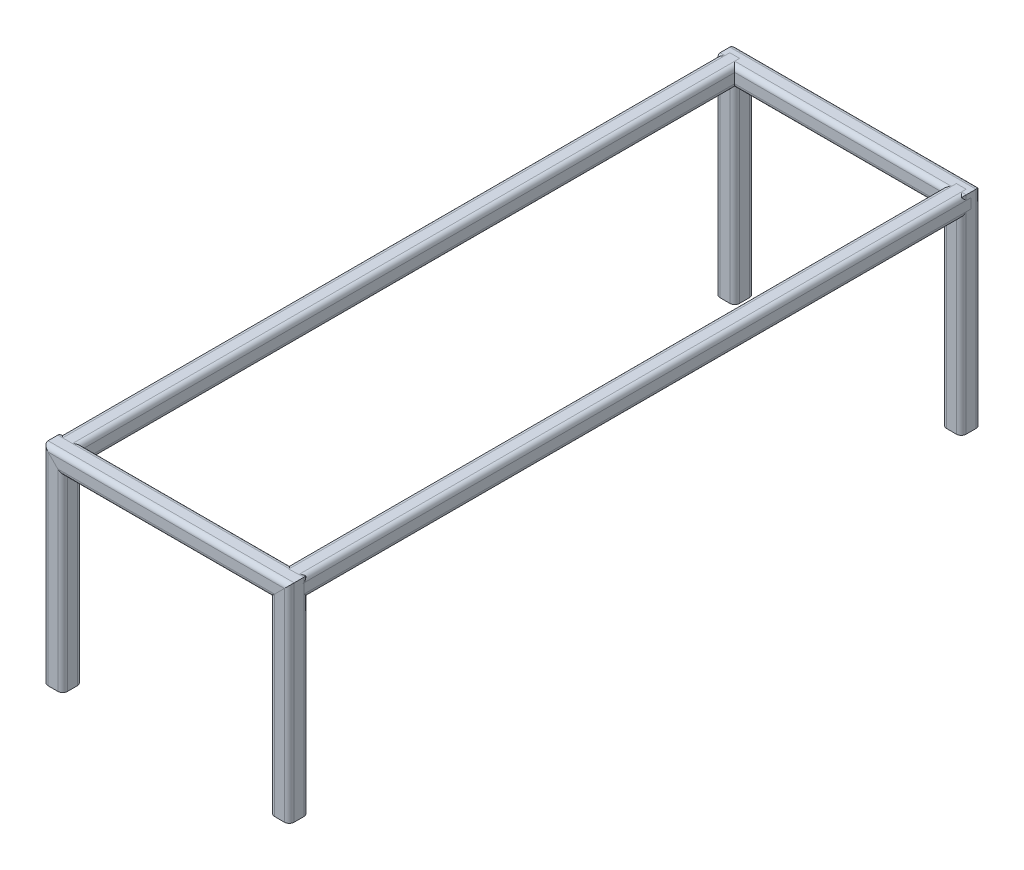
from build123d import *

# Parameters (mm, degrees)
STRUCTURAL_MEMBER1_DEPTH   = 550.098477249
STRUCTURAL_MEMBER1_2_DEPTH = 662.481553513
STRUCTURAL_MEMBER1_3_DEPTH = 550.098477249
STRUCTURAL_MEMBER1_4_DEPTH = 550.098477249
STRUCTURAL_MEMBER1_5_DEPTH = 662.481553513
STRUCTURAL_MEMBER1_6_DEPTH = 550.098477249
STRUCTURAL_MEMBER2_DEPTH   = 1745.820285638
STRUCTURAL_MEMBER2_2_DEPTH = 1745.820285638


with BuildPart() as part:
    # Sketch1 → Structural Member1 (new body)
    with BuildSketch(Plane(origin=(0, 0, 0), x_dir=(1, 0, 0), z_dir=(0, 1, 0))):
        with BuildLine():
            Line((-12.7, -25.4), (12.7, -25.4))
            ThreePointArc((12.7, -25.4), (21.680256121, -21.680256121), (25.4, -12.7))
            Line((25.4, -12.7), (25.4, 12.7))
            ThreePointArc((25.4, 12.7), (21.680256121, 21.680256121), (12.7, 25.4))
            Line((12.7, 25.4), (-12.7, 25.4))
            ThreePointArc((-12.7, 25.4), (-21.680256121, 21.680256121), (-25.4, 12.7))
            Line((-25.4, 12.7), (-25.4, -12.7))
            ThreePointArc((-25.4, -12.7), (-21.680256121, -21.680256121), (-12.7, -25.4))
        make_face()
        with BuildLine():
            Line((-12.7, -19.05), (12.7, -19.05))
            ThreePointArc((12.7, -19.05), (17.190128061, -17.190128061), (19.05, -12.7))
            Line((19.05, -12.7), (19.05, 12.7))
            ThreePointArc((19.05, 12.7), (17.190128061, 17.190128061), (12.7, 19.05))
            Line((12.7, 19.05), (-12.7, 19.05))
            ThreePointArc((-12.7, 19.05), (-17.190128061, 17.190128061), (-19.05, 12.7))
            Line((-19.05, 12.7), (-19.05, -12.7))
            ThreePointArc((-19.05, -12.7), (-17.190128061, -17.190128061), (-12.7, -19.05))
        make_face(mode=Mode.SUBTRACT)
    extrude(amount=STRUCTURAL_MEMBER1_DEPTH)

    # Structural Member1 mitre 1
    split(bisect_by=Plane(origin=(0, 513.177452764, 0), x_dir=(0.707106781, -0.707106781, 0), z_dir=(-0.707106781, -0.707106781, 0)), keep=Keep.TOP)


with BuildPart() as body_2:
    # Sketch1 on segment 2 (on carried to segment 2) → Structural Member1 2 (new body)
    with BuildSketch(Plane(origin=(-36.921024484, 513.177452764, 0), x_dir=(0, -1, 0), z_dir=(1, 0, 0))):
        with BuildLine():
            Line((-12.7, -25.4), (12.7, -25.4))
            ThreePointArc((12.7, -25.4), (21.680256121, -21.680256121), (25.4, -12.7))
            Line((25.4, -12.7), (25.4, 12.7))
            ThreePointArc((25.4, 12.7), (21.680256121, 21.680256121), (12.7, 25.4))
            Line((12.7, 25.4), (-12.7, 25.4))
            ThreePointArc((-12.7, 25.4), (-21.680256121, 21.680256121), (-25.4, 12.7))
            Line((-25.4, 12.7), (-25.4, -12.7))
            ThreePointArc((-25.4, -12.7), (-21.680256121, -21.680256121), (-12.7, -25.4))
        make_face()
        with BuildLine():
            Line((-12.7, -19.05), (12.7, -19.05))
            ThreePointArc((12.7, -19.05), (17.190128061, -17.190128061), (19.05, -12.7))
            Line((19.05, -12.7), (19.05, 12.7))
            ThreePointArc((19.05, 12.7), (17.190128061, 17.190128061), (12.7, 19.05))
            Line((12.7, 19.05), (-12.7, 19.05))
            ThreePointArc((-12.7, 19.05), (-17.190128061, 17.190128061), (-19.05, 12.7))
            Line((-19.05, 12.7), (-19.05, -12.7))
            ThreePointArc((-19.05, -12.7), (-17.190128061, -17.190128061), (-12.7, -19.05))
        make_face(mode=Mode.SUBTRACT)
    extrude(amount=STRUCTURAL_MEMBER1_2_DEPTH)

    # Structural Member1 2 mitre 1
    split(bisect_by=Plane(origin=(0, 513.177452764, 0), x_dir=(-0.707106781, 0.707106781, 0), z_dir=(0.707106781, 0.707106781, 0)), keep=Keep.TOP)

    # Structural Member1 2 mitre 2
    split(bisect_by=Plane(origin=(588.639504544, 513.177452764, 0), x_dir=(-0.707106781, -0.707106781, 0), z_dir=(-0.707106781, 0.707106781, 0)), keep=Keep.TOP)


with BuildPart() as body_3:
    # Sketch1 on segment 3 (on carried to segment 3) → Structural Member1 3 (new body)
    with BuildSketch(Plane(origin=(588.639504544, 550.098477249, 0), x_dir=(-1, 0, 0), z_dir=(0, -1, 0))):
        with BuildLine():
            Line((-12.7, -25.4), (12.7, -25.4))
            ThreePointArc((12.7, -25.4), (21.680256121, -21.680256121), (25.4, -12.7))
            Line((25.4, -12.7), (25.4, 12.7))
            ThreePointArc((25.4, 12.7), (21.680256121, 21.680256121), (12.7, 25.4))
            Line((12.7, 25.4), (-12.7, 25.4))
            ThreePointArc((-12.7, 25.4), (-21.680256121, 21.680256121), (-25.4, 12.7))
            Line((-25.4, 12.7), (-25.4, -12.7))
            ThreePointArc((-25.4, -12.7), (-21.680256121, -21.680256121), (-12.7, -25.4))
        make_face()
        with BuildLine():
            Line((-12.7, -19.05), (12.7, -19.05))
            ThreePointArc((12.7, -19.05), (17.190128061, -17.190128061), (19.05, -12.7))
            Line((19.05, -12.7), (19.05, 12.7))
            ThreePointArc((19.05, 12.7), (17.190128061, 17.190128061), (12.7, 19.05))
            Line((12.7, 19.05), (-12.7, 19.05))
            ThreePointArc((-12.7, 19.05), (-17.190128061, 17.190128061), (-19.05, 12.7))
            Line((-19.05, 12.7), (-19.05, -12.7))
            ThreePointArc((-19.05, -12.7), (-17.190128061, -17.190128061), (-12.7, -19.05))
        make_face(mode=Mode.SUBTRACT)
    extrude(amount=STRUCTURAL_MEMBER1_3_DEPTH)

    # Structural Member1 3 mitre 1
    split(bisect_by=Plane(origin=(588.639504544, 513.177452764, 0), x_dir=(0.707106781, 0.707106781, 0), z_dir=(0.707106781, -0.707106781, 0)), keep=Keep.TOP)


with BuildPart() as body_4:
    # Sketch1 on segment 4 (on carried to segment 4) → Structural Member1 4 (new body)
    with BuildSketch(Plane(origin=(588.639504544, 550.098477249, -1745.820285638), x_dir=(-1, 0, 0), z_dir=(0, -1, 0))):
        with BuildLine():
            Line((-12.7, -25.4), (12.7, -25.4))
            ThreePointArc((12.7, -25.4), (21.680256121, -21.680256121), (25.4, -12.7))
            Line((25.4, -12.7), (25.4, 12.7))
            ThreePointArc((25.4, 12.7), (21.680256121, 21.680256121), (12.7, 25.4))
            Line((12.7, 25.4), (-12.7, 25.4))
            ThreePointArc((-12.7, 25.4), (-21.680256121, 21.680256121), (-25.4, 12.7))
            Line((-25.4, 12.7), (-25.4, -12.7))
            ThreePointArc((-25.4, -12.7), (-21.680256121, -21.680256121), (-12.7, -25.4))
        make_face()
        with BuildLine():
            Line((-12.7, -19.05), (12.7, -19.05))
            ThreePointArc((12.7, -19.05), (17.190128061, -17.190128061), (19.05, -12.7))
            Line((19.05, -12.7), (19.05, 12.7))
            ThreePointArc((19.05, 12.7), (17.190128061, 17.190128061), (12.7, 19.05))
            Line((12.7, 19.05), (-12.7, 19.05))
            ThreePointArc((-12.7, 19.05), (-17.190128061, 17.190128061), (-19.05, 12.7))
            Line((-19.05, 12.7), (-19.05, -12.7))
            ThreePointArc((-19.05, -12.7), (-17.190128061, -17.190128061), (-12.7, -19.05))
        make_face(mode=Mode.SUBTRACT)
    extrude(amount=STRUCTURAL_MEMBER1_4_DEPTH)

    # Structural Member1 4 mitre 1
    split(bisect_by=Plane(origin=(588.639504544, 513.177452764, -1745.820285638), x_dir=(0.707106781, 0.707106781, 0), z_dir=(0.707106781, -0.707106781, 0)), keep=Keep.TOP)


with BuildPart() as body_5:
    # Sketch1 on segment 5 (on carried to segment 5) → Structural Member1 5 (new body)
    with BuildSketch(Plane(origin=(625.560529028, 513.177452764, -1745.820285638), x_dir=(0, 1, 0), z_dir=(-1, 0, 0))):
        with BuildLine():
            Line((-12.7, -25.4), (12.7, -25.4))
            ThreePointArc((12.7, -25.4), (21.680256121, -21.680256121), (25.4, -12.7))
            Line((25.4, -12.7), (25.4, 12.7))
            ThreePointArc((25.4, 12.7), (21.680256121, 21.680256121), (12.7, 25.4))
            Line((12.7, 25.4), (-12.7, 25.4))
            ThreePointArc((-12.7, 25.4), (-21.680256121, 21.680256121), (-25.4, 12.7))
            Line((-25.4, 12.7), (-25.4, -12.7))
            ThreePointArc((-25.4, -12.7), (-21.680256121, -21.680256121), (-12.7, -25.4))
        make_face()
        with BuildLine():
            Line((-12.7, -19.05), (12.7, -19.05))
            ThreePointArc((12.7, -19.05), (17.190128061, -17.190128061), (19.05, -12.7))
            Line((19.05, -12.7), (19.05, 12.7))
            ThreePointArc((19.05, 12.7), (17.190128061, 17.190128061), (12.7, 19.05))
            Line((12.7, 19.05), (-12.7, 19.05))
            ThreePointArc((-12.7, 19.05), (-17.190128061, 17.190128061), (-19.05, 12.7))
            Line((-19.05, 12.7), (-19.05, -12.7))
            ThreePointArc((-19.05, -12.7), (-17.190128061, -17.190128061), (-12.7, -19.05))
        make_face(mode=Mode.SUBTRACT)
    extrude(amount=STRUCTURAL_MEMBER1_5_DEPTH)

    # Structural Member1 5 mitre 1
    split(bisect_by=Plane(origin=(588.639504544, 513.177452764, -1745.820285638), x_dir=(-0.707106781, -0.707106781, 0), z_dir=(-0.707106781, 0.707106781, 0)), keep=Keep.TOP)

    # Structural Member1 5 mitre 2
    split(bisect_by=Plane(origin=(0, 513.177452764, -1745.820285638), x_dir=(-0.707106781, 0.707106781, 0), z_dir=(0.707106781, 0.707106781, 0)), keep=Keep.TOP)


with BuildPart() as body_6:
    # Sketch1 on segment 6 (on carried to segment 6) → Structural Member1 6 (new body)
    with BuildSketch(Plane(origin=(0, 550.098477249, -1745.820285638), x_dir=(-1, 0, 0), z_dir=(0, -1, 0))):
        with BuildLine():
            Line((-12.7, -25.4), (12.7, -25.4))
            ThreePointArc((12.7, -25.4), (21.680256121, -21.680256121), (25.4, -12.7))
            Line((25.4, -12.7), (25.4, 12.7))
            ThreePointArc((25.4, 12.7), (21.680256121, 21.680256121), (12.7, 25.4))
            Line((12.7, 25.4), (-12.7, 25.4))
            ThreePointArc((-12.7, 25.4), (-21.680256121, 21.680256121), (-25.4, 12.7))
            Line((-25.4, 12.7), (-25.4, -12.7))
            ThreePointArc((-25.4, -12.7), (-21.680256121, -21.680256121), (-12.7, -25.4))
        make_face()
        with BuildLine():
            Line((-12.7, -19.05), (12.7, -19.05))
            ThreePointArc((12.7, -19.05), (17.190128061, -17.190128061), (19.05, -12.7))
            Line((19.05, -12.7), (19.05, 12.7))
            ThreePointArc((19.05, 12.7), (17.190128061, 17.190128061), (12.7, 19.05))
            Line((12.7, 19.05), (-12.7, 19.05))
            ThreePointArc((-12.7, 19.05), (-17.190128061, 17.190128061), (-19.05, 12.7))
            Line((-19.05, 12.7), (-19.05, -12.7))
            ThreePointArc((-19.05, -12.7), (-17.190128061, -17.190128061), (-12.7, -19.05))
        make_face(mode=Mode.SUBTRACT)
    extrude(amount=STRUCTURAL_MEMBER1_6_DEPTH)

    # Structural Member1 6 mitre 1
    split(bisect_by=Plane(origin=(0, 513.177452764, -1745.820285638), x_dir=(0.707106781, -0.707106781, 0), z_dir=(-0.707106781, -0.707106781, 0)), keep=Keep.TOP)


with BuildPart() as body_7:
    # Sketch12 → Structural Member2 (new body)
    with BuildSketch(Plane(origin=(0, 513.177452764, 0), x_dir=(1, 0, 0), z_dir=(0, 0, -1))):
        with BuildLine():
            Line((-12.7, -25.4), (12.7, -25.4))
            ThreePointArc((12.7, -25.4), (21.680256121, -21.680256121), (25.4, -12.7))
            Line((25.4, -12.7), (25.4, 12.7))
            ThreePointArc((25.4, 12.7), (21.680256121, 21.680256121), (12.7, 25.4))
            Line((12.7, 25.4), (-12.7, 25.4))
            ThreePointArc((-12.7, 25.4), (-21.680256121, 21.680256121), (-25.4, 12.7))
            Line((-25.4, 12.7), (-25.4, -12.7))
            ThreePointArc((-25.4, -12.7), (-21.680256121, -21.680256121), (-12.7, -25.4))
        make_face()
        with BuildLine():
            Line((-12.7, -19.05), (12.7, -19.05))
            ThreePointArc((12.7, -19.05), (17.190128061, -17.190128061), (19.05, -12.7))
            Line((19.05, -12.7), (19.05, 12.7))
            ThreePointArc((19.05, 12.7), (17.190128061, 17.190128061), (12.7, 19.05))
            Line((12.7, 19.05), (-12.7, 19.05))
            ThreePointArc((-12.7, 19.05), (-17.190128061, 17.190128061), (-19.05, 12.7))
            Line((-19.05, 12.7), (-19.05, -12.7))
            ThreePointArc((-19.05, -12.7), (-17.190128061, -17.190128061), (-12.7, -19.05))
        make_face(mode=Mode.SUBTRACT)
    extrude(amount=STRUCTURAL_MEMBER2_DEPTH)


with BuildPart() as body_8:
    # Sketch12 on segment 2 (on carried to segment 2) → Structural Member2 2 (new body)
    with BuildSketch(Plane(origin=(588.639504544, 513.177452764, 0), x_dir=(1, 0, 0), z_dir=(0, 0, -1))):
        with BuildLine():
            Line((-12.7, -25.4), (12.7, -25.4))
            ThreePointArc((12.7, -25.4), (21.680256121, -21.680256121), (25.4, -12.7))
            Line((25.4, -12.7), (25.4, 12.7))
            ThreePointArc((25.4, 12.7), (21.680256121, 21.680256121), (12.7, 25.4))
            Line((12.7, 25.4), (-12.7, 25.4))
            ThreePointArc((-12.7, 25.4), (-21.680256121, 21.680256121), (-25.4, 12.7))
            Line((-25.4, 12.7), (-25.4, -12.7))
            ThreePointArc((-25.4, -12.7), (-21.680256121, -21.680256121), (-12.7, -25.4))
        make_face()
        with BuildLine():
            Line((-12.7, -19.05), (12.7, -19.05))
            ThreePointArc((12.7, -19.05), (17.190128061, -17.190128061), (19.05, -12.7))
            Line((19.05, -12.7), (19.05, 12.7))
            ThreePointArc((19.05, 12.7), (17.190128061, 17.190128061), (12.7, 19.05))
            Line((12.7, 19.05), (-12.7, 19.05))
            ThreePointArc((-12.7, 19.05), (-17.190128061, 17.190128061), (-19.05, 12.7))
            Line((-19.05, 12.7), (-19.05, -12.7))
            ThreePointArc((-19.05, -12.7), (-17.190128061, -17.190128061), (-12.7, -19.05))
        make_face(mode=Mode.SUBTRACT)
    extrude(amount=STRUCTURAL_MEMBER2_2_DEPTH)


solid = Compound([part.part, body_2.part, body_3.part, body_4.part, body_5.part, body_6.part, body_7.part, body_8.part])
